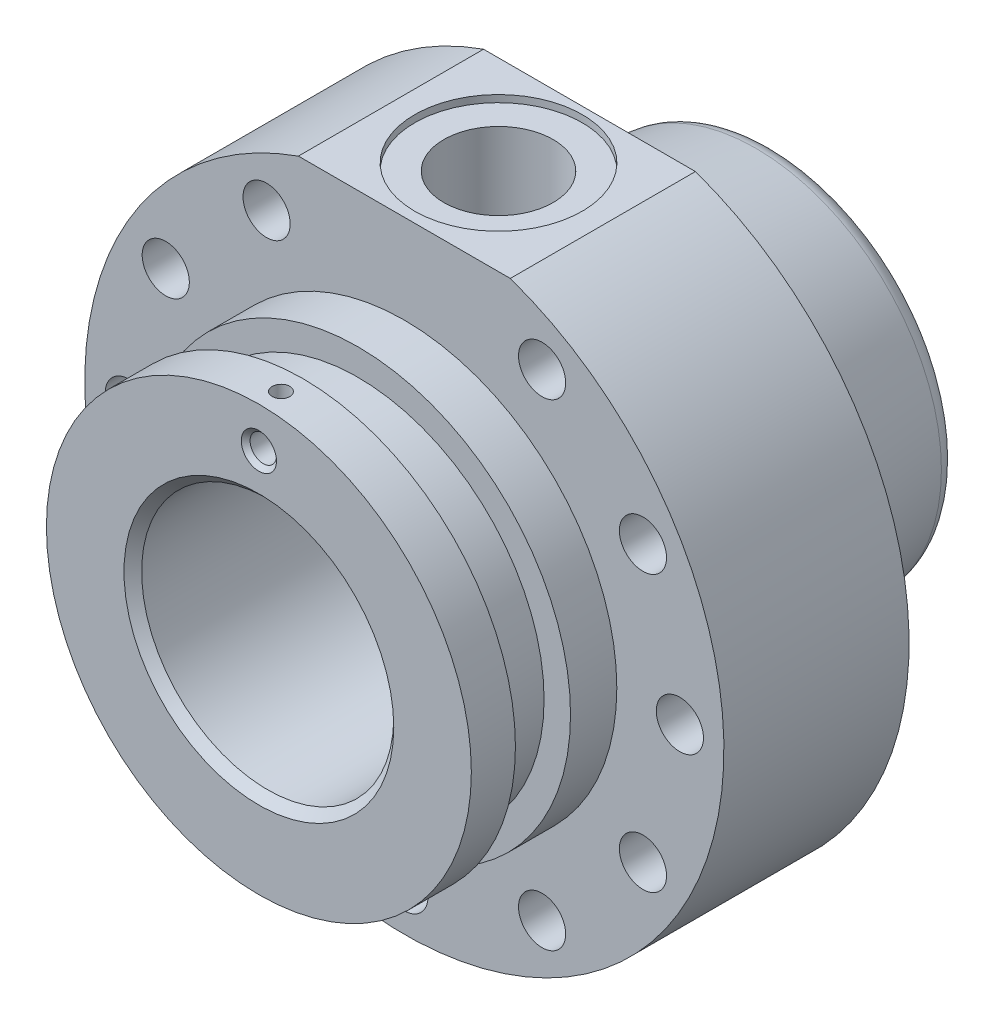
from build123d import *

# Parameters (mm, degrees)
SKETCH1_R               = 72.5
BOSS_EXTRUDE1_DEPTH     = 42
SKETCH2_R               = 48.2
BOSS_EXTRUDE2_DEPTH     = 33
SKETCH4_R               = 28.6
CUT_EXTRUDE1_DEPTH      = 156.568312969
SKETCH5_R               = 35
CUT_EXTRUDE2_DEPTH      = 8
SKETCH6_W               = 12.5
SKETCH6_H               = 6
FILLET1_R               = 5
SKETCH7_R               = 5.35
CUT_EXTRUDE3_DEPTH      = 133.546218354
CIRPATTERN1_COUNT       = 12
CHAMFER1_SIZE           = 2
CUT_EXTRUDE4_DEPTH      = 23
CUT_EXTRUDE4_DEPTH_BACK = 1.6
SKETCH8_W               = 51
SKETCH8_H               = 74.187238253
SKETCH9_R               = 19
CUT_EXTRUDE5_DEPTH      = 1.6
SKETCH10_R              = 5.35
BOSS_EXTRUDE3_DEPTH     = 42
SKETCH11_R              = 12.4
CUT_EXTRUDE6_DEPTH      = 23
CUT_EXTRUDE7_START      = 23
SKETCH13_R              = 19
CUT_EXTRUDE7_DEPTH      = 23
SKETCH14_R              = 7.5
CUT_EXTRUDE8_DEPTH      = 23
CUT_EXTRUDE9_REACH      = 157.568
CUT_EXTRUDE9_END_RADIUS = 7.5
SKETCH15_R              = 3
CHAMFER2_SIZE           = 1
CUT_EXTRUDE10_START     = 40
SKETCH16_R              = 2
CUT_EXTRUDE10_DEPTH     = 88.033460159


with BuildPart() as part:
    # Sketch1 → Boss-Extrude1 (new body)
    with BuildSketch(Plane.XY):
        with Locations(Location((0, 0, 0), (0, 0, 180))):
            Circle(SKETCH1_R)
    extrude(amount=BOSS_EXTRUDE1_DEPTH)

    # Sketch2 → Boss-Extrude2 (add)
    with BuildSketch(Plane.XY.offset(42)):
        Circle(SKETCH2_R)
    extrude(amount=BOSS_EXTRUDE2_DEPTH)

    # Sketch3 → Revolve1 (revolve)
    with BuildSketch(Plane(origin=(0, 0, 0), x_dir=(0, 0, -1), z_dir=(1, 0, 0)), mode=Mode.PRIVATE) as revolve1_sk:
        Polygon((0, 28.6), (42, 28.6), (42, 41.5), (0, 47.6), align=None)
    revolve(revolve1_sk.sketch.rotate(Axis((0, 0, 0), (0, 0, -1)), 90), axis=Axis((0, 0, 0), (0, 0, -1)))

    # Sketch4 → Cut-Extrude1 (cut, through all)
    with BuildSketch(Plane.XY.offset(75)):
        Circle(SKETCH4_R)
    extrude(amount=-CUT_EXTRUDE1_DEPTH, mode=Mode.SUBTRACT)

    # Sketch5 → Cut-Extrude2 (cut)
    with BuildSketch(Plane(origin=(0, 0, -42), x_dir=(-1, 0, 0), z_dir=(0, 0, -1))):
        Circle(SKETCH5_R)
    extrude(amount=-CUT_EXTRUDE2_DEPTH, mode=Mode.SUBTRACT)

    # Sketch6 → Cut-Revolve1 (revolve, cut)
    with BuildSketch(Plane(origin=(0, 0, 0), x_dir=(0, 0, -1), z_dir=(1, 0, 0)), mode=Mode.PRIVATE) as cut_revolve1_sk:
        with Locations((-58.75, 45.2)):
            Rectangle(SKETCH6_W, SKETCH6_H)
    revolve(cut_revolve1_sk.sketch.rotate(Axis((0, 0, 77.085408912), (0, 0, -1)), 90), axis=Axis((0, 0, 77.085408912), (0, 0, -1)), mode=Mode.SUBTRACT)

    # Fillet1
    fillet1_edges = [part.edges().sort_by_distance(p)[0] for p in [
        (-41.5, 0, -42),
    ]]
    fillet(fillet1_edges, radius=FILLET1_R)

    # Sketch7 → Cut-Extrude3 (cut, through all)
    with BuildSketch(Plane.XY.offset(42)):
        with Locations((0, 62.5)):
            Circle(SKETCH7_R)
    cut_extrude3 = extrude(amount=-CUT_EXTRUDE3_DEPTH, mode=Mode.SUBTRACT)

    # CirPattern1: Cut-Extrude3 ×12 about axis
    cirpattern1_axis = Axis((0, 0, 0), (0, 0, 1))
    for i in range(1, CIRPATTERN1_COUNT):
        add(cut_extrude3.rotate(cirpattern1_axis, i * 360 / CIRPATTERN1_COUNT), mode=Mode.SUBTRACT)

    # Chamfer1
    chamfer1_edges = [part.edges().sort_by_distance(p)[0] for p in [
        (-28.6, 0, 75),
    ]]
    chamfer(chamfer1_edges, length=CHAMFER1_SIZE)

    # Sketch8 → Cut-Extrude4 (cut, two sides: drawn at the far end of the back side and taken through both)
    with BuildSketch(Plane(origin=(0, 70, 0), x_dir=(1, 0, 0), z_dir=(0, 1, 0)).offset(-CUT_EXTRUDE4_DEPTH_BACK)):
        with Locations((0, -21.493371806)):
            Rectangle(SKETCH8_W, SKETCH8_H)
    extrude(amount=CUT_EXTRUDE4_DEPTH + CUT_EXTRUDE4_DEPTH_BACK, mode=Mode.SUBTRACT)

    # Sketch9 → Cut-Extrude5 (cut)
    with BuildSketch(Plane(origin=(0, 68.4, 0), x_dir=(1, 0, 0), z_dir=(0, 1, 0))):
        with Locations(Location((0, -20.64035824, 0), (0, 0, 270))):
            Circle(SKETCH9_R)
    extrude(amount=-CUT_EXTRUDE5_DEPTH, mode=Mode.SUBTRACT)

    # Sketch10 → Boss-Extrude3 (add)
    with BuildSketch(Plane.XY.offset(42)):
        with Locations((0, 62.5)):
            Circle(SKETCH10_R)
    extrude(amount=-BOSS_EXTRUDE3_DEPTH)

    # Sketch11 → Cut-Extrude6 (cut)
    with BuildSketch(Plane(origin=(0, 66.8, 0), x_dir=(1, 0, 0), z_dir=(0, 1, 0))):
        with Locations(Location((0, -20.64035824, 0), (0, 0, 270))):
            Circle(SKETCH11_R)
    extrude(amount=-CUT_EXTRUDE6_DEPTH, mode=Mode.SUBTRACT)

    # Sketch13 → Cut-Extrude7 (cut)
    with BuildSketch(Plane(origin=(0, 66.8, 0), x_dir=(1, 0, 0), z_dir=(0, 1, 0)).offset(CUT_EXTRUDE7_START)):
        with Locations(Location((0, -20.64035824, 0), (0, 0, 270))):
            Circle(SKETCH13_R)
    extrude(amount=-CUT_EXTRUDE7_DEPTH, mode=Mode.SUBTRACT)

    # Sketch14 → Cut-Extrude8 (cut)
    with BuildSketch(Plane(origin=(0, 43.8, 0), x_dir=(1, 0, 0), z_dir=(0, 1, 0))):
        with Locations(Location((0, -20.64035824, 0), (0, 0, 270))):
            Circle(SKETCH14_R)
    extrude(amount=-CUT_EXTRUDE8_DEPTH, mode=Mode.SUBTRACT)

    # Cut-Extrude9: up to this cylinder (the profile starts outside it)
    cut_extrude9_end = Plane(origin=(0, 39, 20.64035824), z_dir=(0, 1, 0)) * Cylinder(CUT_EXTRUDE9_END_RADIUS, 331.136, mode=Mode.PRIVATE)
    # Sketch15 → Cut-Extrude9 (cut, up to the surface)
    with BuildSketch(Plane.XY.offset(75), mode=Mode.PRIVATE) as cut_extrude9_sk1:
        with Locations((0, 39)):
            Circle(SKETCH15_R)
    cut_extrude9_tool1 = extrude(cut_extrude9_sk1.sketch, amount=-CUT_EXTRUDE9_REACH, mode=Mode.PRIVATE) - cut_extrude9_end
    add(cut_extrude9_tool1.solids().sort_by_distance((0, 39, 75))[0], mode=Mode.SUBTRACT)

    # Chamfer2
    chamfer2_edges = [part.edges().sort_by_distance(p)[0] for p in [
        (-3, 39, 75),
    ]]
    chamfer(chamfer2_edges, length=CHAMFER2_SIZE)

    # Sketch16 → Cut-Extrude10 (cut, through all)
    with BuildSketch(Plane(origin=(0, 0, 0), x_dir=(1, 0, 0), z_dir=(0, 1, 0)).offset(CUT_EXTRUDE10_START)):
        with Locations(Location((0, -70, 0), (0, 0, 90))):
            Circle(SKETCH16_R)
    extrude(amount=CUT_EXTRUDE10_DEPTH, mode=Mode.SUBTRACT)


solid = part.part
